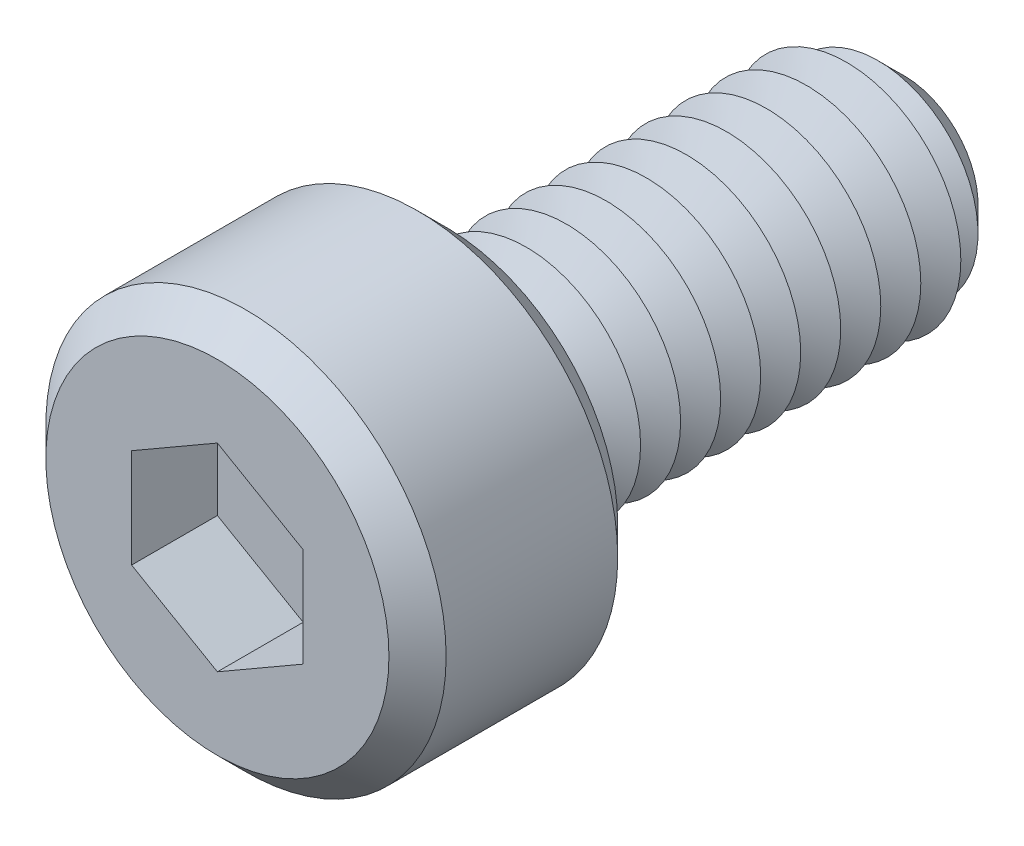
ISO-10303-21;
HEADER;
FILE_DESCRIPTION(('STEP AP214'),'2;1');
FILE_NAME('part.step','',(''),(''),'','','');
FILE_SCHEMA(('AUTOMOTIVE_DESIGN { 1 0 10303 214 1 1 1 1 }'));
ENDSEC;
DATA;
#1=APPLICATION_CONTEXT('core data for automotive mechanical design processes');
#2=APPLICATION_PROTOCOL_DEFINITION('international standard','automotive_design',2000,#1);
#3=PRODUCT_CONTEXT('',#1,'mechanical');
#4=PRODUCT('Part','Part','',(#3));
#5=PRODUCT_RELATED_PRODUCT_CATEGORY('part','',(#4));
#6=PRODUCT_DEFINITION_FORMATION('','',#4);
#7=PRODUCT_DEFINITION_CONTEXT('part definition',#1,'design');
#8=PRODUCT_DEFINITION('design','',#6,#7);
#9=PRODUCT_DEFINITION_SHAPE('','',#8);
#10=(LENGTH_UNIT() NAMED_UNIT(*) SI_UNIT(.MILLI.,.METRE.));
#11=(NAMED_UNIT(*) PLANE_ANGLE_UNIT() SI_UNIT($,.RADIAN.));
#12=(NAMED_UNIT(*) SI_UNIT($,.STERADIAN.) SOLID_ANGLE_UNIT());
#13=UNCERTAINTY_MEASURE_WITH_UNIT(LENGTH_MEASURE(1.E-05),#10,'distance_accuracy_value','');
#14=(GEOMETRIC_REPRESENTATION_CONTEXT(3) GLOBAL_UNCERTAINTY_ASSIGNED_CONTEXT((#13)) GLOBAL_UNIT_ASSIGNED_CONTEXT((#10,
#11,#12)) REPRESENTATION_CONTEXT('',''));
#15=CARTESIAN_POINT('',(0.,0.,0.));
#16=DIRECTION('',(0.,0.,1.));
#17=DIRECTION('',(1.,0.,0.));
#18=AXIS2_PLACEMENT_3D('',#15,#16,#17);
#19=CARTESIAN_POINT('',(0.,0.,4.));
#20=DIRECTION('',(0.,0.,-1.));
#21=DIRECTION('',(-1.,0.,0.));
#22=AXIS2_PLACEMENT_3D('',#19,#20,#21);
#23=CYLINDRICAL_SURFACE('',#22,3.5);
#24=CARTESIAN_POINT('',(0.,0.,0.5));
#25=DIRECTION('',(0.,0.,1.));
#26=DIRECTION('',(1.,0.,0.));
#27=AXIS2_PLACEMENT_3D('',#24,#25,#26);
#28=CIRCLE('',#27,3.5);
#29=CARTESIAN_POINT('',(3.5,0.,0.5));
#30=VERTEX_POINT('',#29);
#31=EDGE_CURVE('E264',#30,#30,#28,.T.);
#32=ORIENTED_EDGE('',*,*,#31,.T.);
#33=EDGE_LOOP('',(#32));
#34=FACE_BOUND('',#33,.T.);
#35=CARTESIAN_POINT('',(0.,0.,3.5));
#36=DIRECTION('',(0.,0.,1.));
#37=DIRECTION('',(1.,0.,0.));
#38=AXIS2_PLACEMENT_3D('',#35,#36,#37);
#39=CIRCLE('',#38,3.5);
#40=CARTESIAN_POINT('',(3.5,0.,3.5));
#41=VERTEX_POINT('',#40);
#42=EDGE_CURVE('E257',#41,#41,#39,.F.);
#43=ORIENTED_EDGE('',*,*,#42,.T.);
#44=EDGE_LOOP('',(#43));
#45=FACE_BOUND('',#44,.T.);
#46=ADVANCED_FACE('F39',(#34,#45),#23,.T.);
#47=CARTESIAN_POINT('',(0.,0.,4.));
#48=DIRECTION('',(0.,0.,1.));
#49=DIRECTION('',(1.,0.,0.));
#50=AXIS2_PLACEMENT_3D('',#47,#48,#49);
#51=PLANE('',#50);
#52=CARTESIAN_POINT('',(0.,0.,4.));
#53=DIRECTION('',(0.,0.,1.));
#54=DIRECTION('',(1.,0.,0.));
#55=AXIS2_PLACEMENT_3D('',#52,#53,#54);
#56=CIRCLE('',#55,3.);
#57=CARTESIAN_POINT('',(3.,0.,4.));
#58=VERTEX_POINT('',#57);
#59=EDGE_CURVE('E11',#58,#58,#56,.T.);
#60=ORIENTED_EDGE('',*,*,#59,.T.);
#61=EDGE_LOOP('',(#60));
#62=FACE_BOUND('',#61,.T.);
#63=DIRECTION('',(-0.866025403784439,0.5,0.));
#64=VECTOR('',#63,1.);
#65=CARTESIAN_POINT('',(1.5,0.866025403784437,4.));
#66=LINE('',#65,#64);
#67=CARTESIAN_POINT('',(1.5,0.866025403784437,4.));
#68=VERTEX_POINT('',#67);
#69=CARTESIAN_POINT('',(0.,1.73205080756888,4.));
#70=VERTEX_POINT('',#69);
#71=EDGE_CURVE('E55',#68,#70,#66,.T.);
#72=ORIENTED_EDGE('',*,*,#71,.F.);
#73=DIRECTION('',(0.,1.,0.));
#74=VECTOR('',#73,1.);
#75=CARTESIAN_POINT('',(1.5,-0.866025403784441,4.));
#76=LINE('',#75,#74);
#77=CARTESIAN_POINT('',(1.5,-0.866025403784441,4.));
#78=VERTEX_POINT('',#77);
#79=EDGE_CURVE('E151',#78,#68,#76,.T.);
#80=ORIENTED_EDGE('',*,*,#79,.F.);
#81=DIRECTION('',(0.866025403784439,0.5,0.));
#82=VECTOR('',#81,1.);
#83=CARTESIAN_POINT('',(0.,-1.73205080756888,4.));
#84=LINE('',#83,#82);
#85=CARTESIAN_POINT('',(0.,-1.73205080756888,4.));
#86=VERTEX_POINT('',#85);
#87=EDGE_CURVE('E148',#86,#78,#84,.T.);
#88=ORIENTED_EDGE('',*,*,#87,.F.);
#89=DIRECTION('',(0.866025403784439,-0.5,0.));
#90=VECTOR('',#89,1.);
#91=CARTESIAN_POINT('',(-1.5,-0.86602540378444,4.));
#92=LINE('',#91,#90);
#93=CARTESIAN_POINT('',(-1.5,-0.86602540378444,4.));
#94=VERTEX_POINT('',#93);
#95=EDGE_CURVE('E103',#94,#86,#92,.T.);
#96=ORIENTED_EDGE('',*,*,#95,.F.);
#97=DIRECTION('',(0.,-1.,0.));
#98=VECTOR('',#97,1.);
#99=CARTESIAN_POINT('',(-1.5,0.866025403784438,4.));
#100=LINE('',#99,#98);
#101=CARTESIAN_POINT('',(-1.5,0.866025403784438,4.));
#102=VERTEX_POINT('',#101);
#103=EDGE_CURVE('E142',#102,#94,#100,.T.);
#104=ORIENTED_EDGE('',*,*,#103,.F.);
#105=DIRECTION('',(-0.866025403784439,-0.5,0.));
#106=VECTOR('',#105,1.);
#107=CARTESIAN_POINT('',(0.,1.73205080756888,4.));
#108=LINE('',#107,#106);
#109=EDGE_CURVE('E137',#70,#102,#108,.T.);
#110=ORIENTED_EDGE('',*,*,#109,.F.);
#111=EDGE_LOOP('',(#72,#80,#88,#96,#104,#110));
#112=FACE_BOUND('',#111,.T.);
#113=ADVANCED_FACE('F282',(#62,#112),#51,.T.);
#114=CARTESIAN_POINT('',(0.,0.,0.));
#115=DIRECTION('',(0.,0.,1.));
#116=DIRECTION('',(1.,0.,0.));
#117=AXIS2_PLACEMENT_3D('',#114,#115,#116);
#118=PLANE('',#117);
#119=CARTESIAN_POINT('',(0.,0.,0.));
#120=DIRECTION('',(0.,0.,1.));
#121=DIRECTION('',(1.,0.,0.));
#122=AXIS2_PLACEMENT_3D('',#119,#120,#121);
#123=CIRCLE('',#122,3.);
#124=CARTESIAN_POINT('',(3.,0.,0.));
#125=VERTEX_POINT('',#124);
#126=EDGE_CURVE('E48',#125,#125,#123,.F.);
#127=ORIENTED_EDGE('',*,*,#126,.T.);
#128=EDGE_LOOP('',(#127));
#129=FACE_BOUND('',#128,.T.);
#130=CARTESIAN_POINT('',(0.,0.,0.));
#131=DIRECTION('',(0.,0.,1.));
#132=DIRECTION('',(1.,0.,0.));
#133=AXIS2_PLACEMENT_3D('',#130,#131,#132);
#134=CIRCLE('',#133,2.);
#135=CARTESIAN_POINT('',(2.,0.,0.));
#136=VERTEX_POINT('',#135);
#137=EDGE_CURVE('E249',#136,#136,#134,.T.);
#138=ORIENTED_EDGE('',*,*,#137,.T.);
#139=EDGE_LOOP('',(#138));
#140=FACE_BOUND('',#139,.T.);
#141=ADVANCED_FACE('F271',(#129,#140),#118,.F.);
#142=CARTESIAN_POINT('',(0.,0.,0.));
#143=DIRECTION('',(0.,0.,1.));
#144=DIRECTION('',(1.,0.,0.));
#145=AXIS2_PLACEMENT_3D('',#142,#143,#144);
#146=CONICAL_SURFACE('',#145,2.,1.0471975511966);
#147=CARTESIAN_POINT('',(0.,0.,-0.35));
#148=DIRECTION('',(0.,0.,1.));
#149=DIRECTION('',(1.,0.,0.));
#150=AXIS2_PLACEMENT_3D('',#147,#148,#149);
#151=CIRCLE('',#150,1.39378221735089);
#152=CARTESIAN_POINT('',(1.39378221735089,0.,-0.35));
#153=VERTEX_POINT('',#152);
#154=EDGE_CURVE('E245',#153,#153,#151,.T.);
#155=ORIENTED_EDGE('',*,*,#154,.T.);
#156=EDGE_LOOP('',(#155));
#157=FACE_BOUND('',#156,.T.);
#158=ORIENTED_EDGE('',*,*,#137,.F.);
#159=EDGE_LOOP('',(#158));
#160=FACE_BOUND('',#159,.T.);
#161=ADVANCED_FACE('F420',(#157,#160),#146,.T.);
#162=CARTESIAN_POINT('',(0.,0.,-0.35));
#163=DIRECTION('',(0.,0.,-1.));
#164=DIRECTION('',(-1.,0.,0.));
#165=AXIS2_PLACEMENT_3D('',#162,#163,#164);
#166=CONICAL_SURFACE('',#165,1.39378221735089,1.0471975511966);
#167=CARTESIAN_POINT('',(0.,0.,-0.7));
#168=DIRECTION('',(0.,0.,1.));
#169=DIRECTION('',(1.,0.,0.));
#170=AXIS2_PLACEMENT_3D('',#167,#168,#169);
#171=CIRCLE('',#170,2.);
#172=CARTESIAN_POINT('',(2.,0.,-0.7));
#173=VERTEX_POINT('',#172);
#174=EDGE_CURVE('E241',#173,#173,#171,.T.);
#175=ORIENTED_EDGE('',*,*,#174,.T.);
#176=EDGE_LOOP('',(#175));
#177=FACE_BOUND('',#176,.T.);
#178=ORIENTED_EDGE('',*,*,#154,.F.);
#179=EDGE_LOOP('',(#178));
#180=FACE_BOUND('',#179,.T.);
#181=ADVANCED_FACE('F416',(#177,#180),#166,.T.);
#182=CARTESIAN_POINT('',(0.,0.,-0.7));
#183=DIRECTION('',(0.,0.,1.));
#184=DIRECTION('',(1.,0.,0.));
#185=AXIS2_PLACEMENT_3D('',#182,#183,#184);
#186=CONICAL_SURFACE('',#185,2.,1.0471975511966);
#187=CARTESIAN_POINT('',(0.,0.,-1.05));
#188=DIRECTION('',(0.,0.,1.));
#189=DIRECTION('',(1.,0.,0.));
#190=AXIS2_PLACEMENT_3D('',#187,#188,#189);
#191=CIRCLE('',#190,1.39378221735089);
#192=CARTESIAN_POINT('',(1.39378221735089,0.,-1.05));
#193=VERTEX_POINT('',#192);
#194=EDGE_CURVE('E237',#193,#193,#191,.T.);
#195=ORIENTED_EDGE('',*,*,#194,.T.);
#196=EDGE_LOOP('',(#195));
#197=FACE_BOUND('',#196,.T.);
#198=ORIENTED_EDGE('',*,*,#174,.F.);
#199=EDGE_LOOP('',(#198));
#200=FACE_BOUND('',#199,.T.);
#201=ADVANCED_FACE('F412',(#197,#200),#186,.T.);
#202=CARTESIAN_POINT('',(0.,0.,-1.05));
#203=DIRECTION('',(0.,0.,-1.));
#204=DIRECTION('',(-1.,0.,0.));
#205=AXIS2_PLACEMENT_3D('',#202,#203,#204);
#206=CONICAL_SURFACE('',#205,1.39378221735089,1.0471975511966);
#207=CARTESIAN_POINT('',(0.,0.,-1.4));
#208=DIRECTION('',(0.,0.,1.));
#209=DIRECTION('',(1.,0.,0.));
#210=AXIS2_PLACEMENT_3D('',#207,#208,#209);
#211=CIRCLE('',#210,2.);
#212=CARTESIAN_POINT('',(2.,0.,-1.4));
#213=VERTEX_POINT('',#212);
#214=EDGE_CURVE('E233',#213,#213,#211,.T.);
#215=ORIENTED_EDGE('',*,*,#214,.T.);
#216=EDGE_LOOP('',(#215));
#217=FACE_BOUND('',#216,.T.);
#218=ORIENTED_EDGE('',*,*,#194,.F.);
#219=EDGE_LOOP('',(#218));
#220=FACE_BOUND('',#219,.T.);
#221=ADVANCED_FACE('F408',(#217,#220),#206,.T.);
#222=CARTESIAN_POINT('',(0.,0.,-1.4));
#223=DIRECTION('',(0.,0.,1.));
#224=DIRECTION('',(1.,0.,0.));
#225=AXIS2_PLACEMENT_3D('',#222,#223,#224);
#226=CONICAL_SURFACE('',#225,2.,1.0471975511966);
#227=CARTESIAN_POINT('',(0.,0.,-1.75));
#228=DIRECTION('',(0.,0.,1.));
#229=DIRECTION('',(1.,0.,0.));
#230=AXIS2_PLACEMENT_3D('',#227,#228,#229);
#231=CIRCLE('',#230,1.39378221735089);
#232=CARTESIAN_POINT('',(1.39378221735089,0.,-1.75));
#233=VERTEX_POINT('',#232);
#234=EDGE_CURVE('E229',#233,#233,#231,.T.);
#235=ORIENTED_EDGE('',*,*,#234,.T.);
#236=EDGE_LOOP('',(#235));
#237=FACE_BOUND('',#236,.T.);
#238=ORIENTED_EDGE('',*,*,#214,.F.);
#239=EDGE_LOOP('',(#238));
#240=FACE_BOUND('',#239,.T.);
#241=ADVANCED_FACE('F404',(#237,#240),#226,.T.);
#242=CARTESIAN_POINT('',(0.,0.,-1.75));
#243=DIRECTION('',(0.,0.,-1.));
#244=DIRECTION('',(-1.,0.,0.));
#245=AXIS2_PLACEMENT_3D('',#242,#243,#244);
#246=CONICAL_SURFACE('',#245,1.39378221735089,1.0471975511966);
#247=CARTESIAN_POINT('',(0.,0.,-2.1));
#248=DIRECTION('',(0.,0.,1.));
#249=DIRECTION('',(1.,0.,0.));
#250=AXIS2_PLACEMENT_3D('',#247,#248,#249);
#251=CIRCLE('',#250,2.);
#252=CARTESIAN_POINT('',(2.,0.,-2.1));
#253=VERTEX_POINT('',#252);
#254=EDGE_CURVE('E225',#253,#253,#251,.T.);
#255=ORIENTED_EDGE('',*,*,#254,.T.);
#256=EDGE_LOOP('',(#255));
#257=FACE_BOUND('',#256,.T.);
#258=ORIENTED_EDGE('',*,*,#234,.F.);
#259=EDGE_LOOP('',(#258));
#260=FACE_BOUND('',#259,.T.);
#261=ADVANCED_FACE('F400',(#257,#260),#246,.T.);
#262=CARTESIAN_POINT('',(0.,0.,-2.1));
#263=DIRECTION('',(0.,0.,1.));
#264=DIRECTION('',(1.,0.,0.));
#265=AXIS2_PLACEMENT_3D('',#262,#263,#264);
#266=CONICAL_SURFACE('',#265,2.,1.0471975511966);
#267=CARTESIAN_POINT('',(0.,0.,-2.45));
#268=DIRECTION('',(0.,0.,1.));
#269=DIRECTION('',(1.,0.,0.));
#270=AXIS2_PLACEMENT_3D('',#267,#268,#269);
#271=CIRCLE('',#270,1.39378221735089);
#272=CARTESIAN_POINT('',(1.39378221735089,0.,-2.45));
#273=VERTEX_POINT('',#272);
#274=EDGE_CURVE('E221',#273,#273,#271,.T.);
#275=ORIENTED_EDGE('',*,*,#274,.T.);
#276=EDGE_LOOP('',(#275));
#277=FACE_BOUND('',#276,.T.);
#278=ORIENTED_EDGE('',*,*,#254,.F.);
#279=EDGE_LOOP('',(#278));
#280=FACE_BOUND('',#279,.T.);
#281=ADVANCED_FACE('F396',(#277,#280),#266,.T.);
#282=CARTESIAN_POINT('',(0.,0.,-2.45));
#283=DIRECTION('',(0.,0.,-1.));
#284=DIRECTION('',(-1.,0.,0.));
#285=AXIS2_PLACEMENT_3D('',#282,#283,#284);
#286=CONICAL_SURFACE('',#285,1.39378221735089,1.0471975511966);
#287=CARTESIAN_POINT('',(0.,0.,-2.8));
#288=DIRECTION('',(0.,0.,1.));
#289=DIRECTION('',(1.,0.,0.));
#290=AXIS2_PLACEMENT_3D('',#287,#288,#289);
#291=CIRCLE('',#290,2.);
#292=CARTESIAN_POINT('',(2.,0.,-2.8));
#293=VERTEX_POINT('',#292);
#294=EDGE_CURVE('E217',#293,#293,#291,.T.);
#295=ORIENTED_EDGE('',*,*,#294,.T.);
#296=EDGE_LOOP('',(#295));
#297=FACE_BOUND('',#296,.T.);
#298=ORIENTED_EDGE('',*,*,#274,.F.);
#299=EDGE_LOOP('',(#298));
#300=FACE_BOUND('',#299,.T.);
#301=ADVANCED_FACE('F392',(#297,#300),#286,.T.);
#302=CARTESIAN_POINT('',(0.,0.,-2.8));
#303=DIRECTION('',(0.,0.,1.));
#304=DIRECTION('',(1.,0.,0.));
#305=AXIS2_PLACEMENT_3D('',#302,#303,#304);
#306=CONICAL_SURFACE('',#305,2.,1.0471975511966);
#307=CARTESIAN_POINT('',(0.,0.,-3.15));
#308=DIRECTION('',(0.,0.,1.));
#309=DIRECTION('',(1.,0.,0.));
#310=AXIS2_PLACEMENT_3D('',#307,#308,#309);
#311=CIRCLE('',#310,1.39378221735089);
#312=CARTESIAN_POINT('',(1.39378221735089,0.,-3.15));
#313=VERTEX_POINT('',#312);
#314=EDGE_CURVE('E214',#313,#313,#311,.T.);
#315=ORIENTED_EDGE('',*,*,#314,.T.);
#316=EDGE_LOOP('',(#315));
#317=FACE_BOUND('',#316,.T.);
#318=ORIENTED_EDGE('',*,*,#294,.F.);
#319=EDGE_LOOP('',(#318));
#320=FACE_BOUND('',#319,.T.);
#321=ADVANCED_FACE('F388',(#317,#320),#306,.T.);
#322=CARTESIAN_POINT('',(0.,0.,-3.15));
#323=DIRECTION('',(0.,0.,-1.));
#324=DIRECTION('',(-1.,0.,0.));
#325=AXIS2_PLACEMENT_3D('',#322,#323,#324);
#326=CONICAL_SURFACE('',#325,1.39378221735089,1.0471975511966);
#327=CARTESIAN_POINT('',(0.,0.,-3.5));
#328=DIRECTION('',(0.,0.,1.));
#329=DIRECTION('',(1.,0.,0.));
#330=AXIS2_PLACEMENT_3D('',#327,#328,#329);
#331=CIRCLE('',#330,2.);
#332=CARTESIAN_POINT('',(2.,0.,-3.5));
#333=VERTEX_POINT('',#332);
#334=EDGE_CURVE('E210',#333,#333,#331,.T.);
#335=ORIENTED_EDGE('',*,*,#334,.T.);
#336=EDGE_LOOP('',(#335));
#337=FACE_BOUND('',#336,.T.);
#338=ORIENTED_EDGE('',*,*,#314,.F.);
#339=EDGE_LOOP('',(#338));
#340=FACE_BOUND('',#339,.T.);
#341=ADVANCED_FACE('F384',(#337,#340),#326,.T.);
#342=CARTESIAN_POINT('',(0.,0.,-3.5));
#343=DIRECTION('',(0.,0.,1.));
#344=DIRECTION('',(1.,0.,0.));
#345=AXIS2_PLACEMENT_3D('',#342,#343,#344);
#346=CONICAL_SURFACE('',#345,2.,1.0471975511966);
#347=CARTESIAN_POINT('',(0.,0.,-3.85));
#348=DIRECTION('',(0.,0.,1.));
#349=DIRECTION('',(1.,0.,0.));
#350=AXIS2_PLACEMENT_3D('',#347,#348,#349);
#351=CIRCLE('',#350,1.39378221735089);
#352=CARTESIAN_POINT('',(1.39378221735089,0.,-3.85));
#353=VERTEX_POINT('',#352);
#354=EDGE_CURVE('E206',#353,#353,#351,.T.);
#355=ORIENTED_EDGE('',*,*,#354,.T.);
#356=EDGE_LOOP('',(#355));
#357=FACE_BOUND('',#356,.T.);
#358=ORIENTED_EDGE('',*,*,#334,.F.);
#359=EDGE_LOOP('',(#358));
#360=FACE_BOUND('',#359,.T.);
#361=ADVANCED_FACE('F380',(#357,#360),#346,.T.);
#362=CARTESIAN_POINT('',(0.,0.,-3.85));
#363=DIRECTION('',(0.,0.,-1.));
#364=DIRECTION('',(-1.,0.,0.));
#365=AXIS2_PLACEMENT_3D('',#362,#363,#364);
#366=CONICAL_SURFACE('',#365,1.39378221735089,1.0471975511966);
#367=CARTESIAN_POINT('',(0.,0.,-4.2));
#368=DIRECTION('',(0.,0.,1.));
#369=DIRECTION('',(1.,0.,0.));
#370=AXIS2_PLACEMENT_3D('',#367,#368,#369);
#371=CIRCLE('',#370,2.);
#372=CARTESIAN_POINT('',(2.,0.,-4.2));
#373=VERTEX_POINT('',#372);
#374=EDGE_CURVE('E202',#373,#373,#371,.T.);
#375=ORIENTED_EDGE('',*,*,#374,.T.);
#376=EDGE_LOOP('',(#375));
#377=FACE_BOUND('',#376,.T.);
#378=ORIENTED_EDGE('',*,*,#354,.F.);
#379=EDGE_LOOP('',(#378));
#380=FACE_BOUND('',#379,.T.);
#381=ADVANCED_FACE('F376',(#377,#380),#366,.T.);
#382=CARTESIAN_POINT('',(0.,0.,-4.2));
#383=DIRECTION('',(0.,0.,1.));
#384=DIRECTION('',(1.,0.,0.));
#385=AXIS2_PLACEMENT_3D('',#382,#383,#384);
#386=CONICAL_SURFACE('',#385,2.,1.0471975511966);
#387=CARTESIAN_POINT('',(0.,0.,-4.55));
#388=DIRECTION('',(0.,0.,1.));
#389=DIRECTION('',(1.,0.,0.));
#390=AXIS2_PLACEMENT_3D('',#387,#388,#389);
#391=CIRCLE('',#390,1.39378221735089);
#392=CARTESIAN_POINT('',(1.39378221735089,0.,-4.55));
#393=VERTEX_POINT('',#392);
#394=EDGE_CURVE('E198',#393,#393,#391,.T.);
#395=ORIENTED_EDGE('',*,*,#394,.T.);
#396=EDGE_LOOP('',(#395));
#397=FACE_BOUND('',#396,.T.);
#398=ORIENTED_EDGE('',*,*,#374,.F.);
#399=EDGE_LOOP('',(#398));
#400=FACE_BOUND('',#399,.T.);
#401=ADVANCED_FACE('F372',(#397,#400),#386,.T.);
#402=CARTESIAN_POINT('',(0.,0.,-4.55));
#403=DIRECTION('',(0.,0.,-1.));
#404=DIRECTION('',(-1.,0.,0.));
#405=AXIS2_PLACEMENT_3D('',#402,#403,#404);
#406=CONICAL_SURFACE('',#405,1.39378221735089,1.0471975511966);
#407=CARTESIAN_POINT('',(0.,0.,-4.9));
#408=DIRECTION('',(0.,0.,1.));
#409=DIRECTION('',(1.,0.,0.));
#410=AXIS2_PLACEMENT_3D('',#407,#408,#409);
#411=CIRCLE('',#410,2.);
#412=CARTESIAN_POINT('',(2.,0.,-4.9));
#413=VERTEX_POINT('',#412);
#414=EDGE_CURVE('E194',#413,#413,#411,.T.);
#415=ORIENTED_EDGE('',*,*,#414,.T.);
#416=EDGE_LOOP('',(#415));
#417=FACE_BOUND('',#416,.T.);
#418=ORIENTED_EDGE('',*,*,#394,.F.);
#419=EDGE_LOOP('',(#418));
#420=FACE_BOUND('',#419,.T.);
#421=ADVANCED_FACE('F368',(#417,#420),#406,.T.);
#422=CARTESIAN_POINT('',(0.,0.,-4.9));
#423=DIRECTION('',(0.,0.,1.));
#424=DIRECTION('',(1.,0.,0.));
#425=AXIS2_PLACEMENT_3D('',#422,#423,#424);
#426=CONICAL_SURFACE('',#425,2.,1.0471975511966);
#427=CARTESIAN_POINT('',(0.,0.,-5.25));
#428=DIRECTION('',(0.,0.,1.));
#429=DIRECTION('',(1.,0.,0.));
#430=AXIS2_PLACEMENT_3D('',#427,#428,#429);
#431=CIRCLE('',#430,1.39378221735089);
#432=CARTESIAN_POINT('',(1.39378221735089,0.,-5.25));
#433=VERTEX_POINT('',#432);
#434=EDGE_CURVE('E190',#433,#433,#431,.T.);
#435=ORIENTED_EDGE('',*,*,#434,.T.);
#436=EDGE_LOOP('',(#435));
#437=FACE_BOUND('',#436,.T.);
#438=ORIENTED_EDGE('',*,*,#414,.F.);
#439=EDGE_LOOP('',(#438));
#440=FACE_BOUND('',#439,.T.);
#441=ADVANCED_FACE('F364',(#437,#440),#426,.T.);
#442=CARTESIAN_POINT('',(0.,0.,-5.25));
#443=DIRECTION('',(0.,0.,-1.));
#444=DIRECTION('',(-1.,0.,0.));
#445=AXIS2_PLACEMENT_3D('',#442,#443,#444);
#446=CONICAL_SURFACE('',#445,1.39378221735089,1.0471975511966);
#447=CARTESIAN_POINT('',(0.,0.,-5.6));
#448=DIRECTION('',(0.,0.,1.));
#449=DIRECTION('',(1.,0.,0.));
#450=AXIS2_PLACEMENT_3D('',#447,#448,#449);
#451=CIRCLE('',#450,2.);
#452=CARTESIAN_POINT('',(2.,0.,-5.6));
#453=VERTEX_POINT('',#452);
#454=EDGE_CURVE('E186',#453,#453,#451,.T.);
#455=ORIENTED_EDGE('',*,*,#454,.T.);
#456=EDGE_LOOP('',(#455));
#457=FACE_BOUND('',#456,.T.);
#458=ORIENTED_EDGE('',*,*,#434,.F.);
#459=EDGE_LOOP('',(#458));
#460=FACE_BOUND('',#459,.T.);
#461=ADVANCED_FACE('F360',(#457,#460),#446,.T.);
#462=CARTESIAN_POINT('',(0.,0.,-5.6));
#463=DIRECTION('',(0.,0.,1.));
#464=DIRECTION('',(1.,0.,0.));
#465=AXIS2_PLACEMENT_3D('',#462,#463,#464);
#466=CONICAL_SURFACE('',#465,2.,1.0471975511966);
#467=CARTESIAN_POINT('',(0.,0.,-5.95));
#468=DIRECTION('',(0.,0.,1.));
#469=DIRECTION('',(1.,0.,0.));
#470=AXIS2_PLACEMENT_3D('',#467,#468,#469);
#471=CIRCLE('',#470,1.39378221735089);
#472=CARTESIAN_POINT('',(1.39378221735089,0.,-5.95));
#473=VERTEX_POINT('',#472);
#474=EDGE_CURVE('E182',#473,#473,#471,.T.);
#475=ORIENTED_EDGE('',*,*,#474,.T.);
#476=EDGE_LOOP('',(#475));
#477=FACE_BOUND('',#476,.T.);
#478=ORIENTED_EDGE('',*,*,#454,.F.);
#479=EDGE_LOOP('',(#478));
#480=FACE_BOUND('',#479,.T.);
#481=ADVANCED_FACE('F356',(#477,#480),#466,.T.);
#482=CARTESIAN_POINT('',(0.,0.,-5.95));
#483=DIRECTION('',(0.,0.,-1.));
#484=DIRECTION('',(-1.,0.,0.));
#485=AXIS2_PLACEMENT_3D('',#482,#483,#484);
#486=CONICAL_SURFACE('',#485,1.39378221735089,1.0471975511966);
#487=CARTESIAN_POINT('',(0.,0.,-6.3));
#488=DIRECTION('',(0.,0.,1.));
#489=DIRECTION('',(1.,0.,0.));
#490=AXIS2_PLACEMENT_3D('',#487,#488,#489);
#491=CIRCLE('',#490,2.);
#492=CARTESIAN_POINT('',(2.,0.,-6.3));
#493=VERTEX_POINT('',#492);
#494=EDGE_CURVE('E178',#493,#493,#491,.T.);
#495=ORIENTED_EDGE('',*,*,#494,.T.);
#496=EDGE_LOOP('',(#495));
#497=FACE_BOUND('',#496,.T.);
#498=ORIENTED_EDGE('',*,*,#474,.F.);
#499=EDGE_LOOP('',(#498));
#500=FACE_BOUND('',#499,.T.);
#501=ADVANCED_FACE('F352',(#497,#500),#486,.T.);
#502=CARTESIAN_POINT('',(0.,0.,-6.3));
#503=DIRECTION('',(0.,0.,1.));
#504=DIRECTION('',(1.,0.,0.));
#505=AXIS2_PLACEMENT_3D('',#502,#503,#504);
#506=CONICAL_SURFACE('',#505,2.,1.0471975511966);
#507=CARTESIAN_POINT('',(0.,0.,-6.65));
#508=DIRECTION('',(0.,0.,1.));
#509=DIRECTION('',(1.,0.,0.));
#510=AXIS2_PLACEMENT_3D('',#507,#508,#509);
#511=CIRCLE('',#510,1.39378221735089);
#512=CARTESIAN_POINT('',(1.39378221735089,0.,-6.65));
#513=VERTEX_POINT('',#512);
#514=EDGE_CURVE('E175',#513,#513,#511,.T.);
#515=ORIENTED_EDGE('',*,*,#514,.T.);
#516=EDGE_LOOP('',(#515));
#517=FACE_BOUND('',#516,.T.);
#518=ORIENTED_EDGE('',*,*,#494,.F.);
#519=EDGE_LOOP('',(#518));
#520=FACE_BOUND('',#519,.T.);
#521=ADVANCED_FACE('F348',(#517,#520),#506,.T.);
#522=CARTESIAN_POINT('',(0.,0.,-6.65));
#523=DIRECTION('',(0.,0.,-1.));
#524=DIRECTION('',(-1.,0.,0.));
#525=AXIS2_PLACEMENT_3D('',#522,#523,#524);
#526=CONICAL_SURFACE('',#525,1.39378221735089,1.0471975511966);
#527=CARTESIAN_POINT('',(0.,0.,-7.));
#528=DIRECTION('',(0.,0.,1.));
#529=DIRECTION('',(1.,0.,0.));
#530=AXIS2_PLACEMENT_3D('',#527,#528,#529);
#531=CIRCLE('',#530,2.);
#532=CARTESIAN_POINT('',(2.,0.,-7.));
#533=VERTEX_POINT('',#532);
#534=EDGE_CURVE('E170',#533,#533,#531,.T.);
#535=ORIENTED_EDGE('',*,*,#534,.T.);
#536=EDGE_LOOP('',(#535));
#537=FACE_BOUND('',#536,.T.);
#538=ORIENTED_EDGE('',*,*,#514,.F.);
#539=EDGE_LOOP('',(#538));
#540=FACE_BOUND('',#539,.T.);
#541=ADVANCED_FACE('F344',(#537,#540),#526,.T.);
#542=CARTESIAN_POINT('',(0.,0.,-7.));
#543=DIRECTION('',(0.,0.,1.));
#544=DIRECTION('',(1.,0.,0.));
#545=AXIS2_PLACEMENT_3D('',#542,#543,#544);
#546=CONICAL_SURFACE('',#545,2.,1.0471975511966);
#547=CARTESIAN_POINT('',(0.,0.,-7.35));
#548=DIRECTION('',(0.,0.,1.));
#549=DIRECTION('',(1.,0.,0.));
#550=AXIS2_PLACEMENT_3D('',#547,#548,#549);
#551=CIRCLE('',#550,1.39378221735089);
#552=CARTESIAN_POINT('',(1.39378221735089,0.,-7.35));
#553=VERTEX_POINT('',#552);
#554=EDGE_CURVE('E157',#553,#553,#551,.T.);
#555=ORIENTED_EDGE('',*,*,#554,.T.);
#556=EDGE_LOOP('',(#555));
#557=FACE_BOUND('',#556,.T.);
#558=ORIENTED_EDGE('',*,*,#534,.F.);
#559=EDGE_LOOP('',(#558));
#560=FACE_BOUND('',#559,.T.);
#561=ADVANCED_FACE('F340',(#557,#560),#546,.T.);
#562=CARTESIAN_POINT('',(0.,0.,-7.35));
#563=DIRECTION('',(0.,0.,-1.));
#564=DIRECTION('',(-1.,0.,0.));
#565=AXIS2_PLACEMENT_3D('',#562,#563,#564);
#566=CONICAL_SURFACE('',#565,1.39378221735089,1.0471975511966);
#567=CARTESIAN_POINT('',(0.,0.,-7.55358983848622));
#568=DIRECTION('',(0.,0.,-1.));
#569=DIRECTION('',(-1.,0.,0.));
#570=AXIS2_PLACEMENT_3D('',#567,#568,#569);
#571=CIRCLE('',#570,1.74641016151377);
#572=CARTESIAN_POINT('',(-1.74641016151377,0.,-7.55358983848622));
#573=VERTEX_POINT('',#572);
#574=EDGE_CURVE('E174',#573,#573,#571,.T.);
#575=ORIENTED_EDGE('',*,*,#574,.F.);
#576=EDGE_LOOP('',(#575));
#577=FACE_BOUND('',#576,.T.);
#578=ORIENTED_EDGE('',*,*,#554,.F.);
#579=EDGE_LOOP('',(#578));
#580=FACE_BOUND('',#579,.T.);
#581=ADVANCED_FACE('F336',(#577,#580),#566,.T.);
#582=CARTESIAN_POINT('',(0.,0.,-8.));
#583=DIRECTION('',(0.,0.,-1.));
#584=DIRECTION('',(-1.,0.,0.));
#585=AXIS2_PLACEMENT_3D('',#582,#583,#584);
#586=PLANE('',#585);
#587=CARTESIAN_POINT('',(0.,0.,-8.));
#588=DIRECTION('',(0.,0.,-1.));
#589=DIRECTION('',(-1.,0.,0.));
#590=AXIS2_PLACEMENT_3D('',#587,#588,#589);
#591=CIRCLE('',#590,0.5);
#592=CARTESIAN_POINT('',(-0.5,0.,-8.));
#593=VERTEX_POINT('',#592);
#594=EDGE_CURVE('E138',#593,#593,#591,.F.);
#595=ORIENTED_EDGE('',*,*,#594,.T.);
#596=EDGE_LOOP('',(#595));
#597=FACE_BOUND('',#596,.T.);
#598=CARTESIAN_POINT('',(0.,0.,-8.));
#599=DIRECTION('',(0.,0.,-1.));
#600=DIRECTION('',(-1.,0.,0.));
#601=AXIS2_PLACEMENT_3D('',#598,#599,#600);
#602=CIRCLE('',#601,1.3);
#603=CARTESIAN_POINT('',(-1.3,0.,-8.));
#604=VERTEX_POINT('',#603);
#605=EDGE_CURVE('E253',#604,#604,#602,.T.);
#606=ORIENTED_EDGE('',*,*,#605,.T.);
#607=EDGE_LOOP('',(#606));
#608=FACE_BOUND('',#607,.T.);
#609=ADVANCED_FACE('F339',(#597,#608),#586,.T.);
#610=CARTESIAN_POINT('',(0.,0.,-8.));
#611=DIRECTION('',(0.,0.,1.));
#612=DIRECTION('',(1.,0.,0.));
#613=AXIS2_PLACEMENT_3D('',#610,#611,#612);
#614=CONICAL_SURFACE('',#613,1.3,0.785398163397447);
#615=ORIENTED_EDGE('',*,*,#605,.F.);
#616=EDGE_LOOP('',(#615));
#617=FACE_BOUND('',#616,.T.);
#618=ORIENTED_EDGE('',*,*,#574,.T.);
#619=EDGE_LOOP('',(#618));
#620=FACE_BOUND('',#619,.T.);
#621=ADVANCED_FACE('F335',(#617,#620),#614,.T.);
#622=CARTESIAN_POINT('',(1.5,0.866025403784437,2.5));
#623=DIRECTION('',(0.5,0.866025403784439,0.));
#624=DIRECTION('',(-0.866025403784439,0.5,0.));
#625=AXIS2_PLACEMENT_3D('',#622,#623,#624);
#626=PLANE('',#625);
#627=ORIENTED_EDGE('',*,*,#71,.T.);
#628=DIRECTION('',(0.,0.,1.));
#629=VECTOR('',#628,1.);
#630=CARTESIAN_POINT('',(0.,1.73205080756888,2.5));
#631=LINE('',#630,#629);
#632=CARTESIAN_POINT('',(0.,1.73205080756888,2.5));
#633=VERTEX_POINT('',#632);
#634=EDGE_CURVE('E85',#633,#70,#631,.T.);
#635=ORIENTED_EDGE('',*,*,#634,.F.);
#636=DIRECTION('',(-0.866025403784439,0.5,0.));
#637=VECTOR('',#636,1.);
#638=CARTESIAN_POINT('',(1.5,0.866025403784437,2.5));
#639=LINE('',#638,#637);
#640=CARTESIAN_POINT('',(1.5,0.866025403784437,2.5));
#641=VERTEX_POINT('',#640);
#642=EDGE_CURVE('E154',#641,#633,#639,.T.);
#643=ORIENTED_EDGE('',*,*,#642,.F.);
#644=DIRECTION('',(0.,0.,1.));
#645=VECTOR('',#644,1.);
#646=CARTESIAN_POINT('',(1.5,0.866025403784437,2.5));
#647=LINE('',#646,#645);
#648=EDGE_CURVE('E63',#641,#68,#647,.T.);
#649=ORIENTED_EDGE('',*,*,#648,.T.);
#650=EDGE_LOOP('',(#627,#635,#643,#649));
#651=FACE_BOUND('',#650,.T.);
#652=ADVANCED_FACE('F325',(#651),#626,.F.);
#653=CARTESIAN_POINT('',(1.5,-0.866025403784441,2.5));
#654=DIRECTION('',(1.,0.,0.));
#655=DIRECTION('',(0.,1.,0.));
#656=AXIS2_PLACEMENT_3D('',#653,#654,#655);
#657=PLANE('',#656);
#658=ORIENTED_EDGE('',*,*,#79,.T.);
#659=ORIENTED_EDGE('',*,*,#648,.F.);
#660=DIRECTION('',(0.,1.,0.));
#661=VECTOR('',#660,1.);
#662=CARTESIAN_POINT('',(1.5,-0.866025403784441,2.5));
#663=LINE('',#662,#661);
#664=CARTESIAN_POINT('',(1.5,-0.866025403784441,2.5));
#665=VERTEX_POINT('',#664);
#666=EDGE_CURVE('E117',#665,#641,#663,.T.);
#667=ORIENTED_EDGE('',*,*,#666,.F.);
#668=DIRECTION('',(0.,0.,1.));
#669=VECTOR('',#668,1.);
#670=CARTESIAN_POINT('',(1.5,-0.866025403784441,2.5));
#671=LINE('',#670,#669);
#672=EDGE_CURVE('E108',#665,#78,#671,.T.);
#673=ORIENTED_EDGE('',*,*,#672,.T.);
#674=EDGE_LOOP('',(#658,#659,#667,#673));
#675=FACE_BOUND('',#674,.T.);
#676=ADVANCED_FACE('F322',(#675),#657,.F.);
#677=CARTESIAN_POINT('',(0.,-1.73205080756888,2.5));
#678=DIRECTION('',(0.5,-0.866025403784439,0.));
#679=DIRECTION('',(0.866025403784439,0.5,0.));
#680=AXIS2_PLACEMENT_3D('',#677,#678,#679);
#681=PLANE('',#680);
#682=ORIENTED_EDGE('',*,*,#87,.T.);
#683=ORIENTED_EDGE('',*,*,#672,.F.);
#684=DIRECTION('',(0.866025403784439,0.5,0.));
#685=VECTOR('',#684,1.);
#686=CARTESIAN_POINT('',(0.,-1.73205080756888,2.5));
#687=LINE('',#686,#685);
#688=CARTESIAN_POINT('',(0.,-1.73205080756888,2.5));
#689=VERTEX_POINT('',#688);
#690=EDGE_CURVE('E112',#689,#665,#687,.T.);
#691=ORIENTED_EDGE('',*,*,#690,.F.);
#692=DIRECTION('',(0.,0.,1.));
#693=VECTOR('',#692,1.);
#694=CARTESIAN_POINT('',(0.,-1.73205080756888,2.5));
#695=LINE('',#694,#693);
#696=EDGE_CURVE('E96',#689,#86,#695,.T.);
#697=ORIENTED_EDGE('',*,*,#696,.T.);
#698=EDGE_LOOP('',(#682,#683,#691,#697));
#699=FACE_BOUND('',#698,.T.);
#700=ADVANCED_FACE('F113',(#699),#681,.F.);
#701=CARTESIAN_POINT('',(-1.5,-0.86602540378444,2.5));
#702=DIRECTION('',(-0.5,-0.866025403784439,0.));
#703=DIRECTION('',(0.866025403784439,-0.5,0.));
#704=AXIS2_PLACEMENT_3D('',#701,#702,#703);
#705=PLANE('',#704);
#706=ORIENTED_EDGE('',*,*,#95,.T.);
#707=ORIENTED_EDGE('',*,*,#696,.F.);
#708=DIRECTION('',(0.866025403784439,-0.5,0.));
#709=VECTOR('',#708,1.);
#710=CARTESIAN_POINT('',(-1.5,-0.86602540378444,2.5));
#711=LINE('',#710,#709);
#712=CARTESIAN_POINT('',(-1.5,-0.86602540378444,2.5));
#713=VERTEX_POINT('',#712);
#714=EDGE_CURVE('E100',#713,#689,#711,.T.);
#715=ORIENTED_EDGE('',*,*,#714,.F.);
#716=DIRECTION('',(0.,0.,1.));
#717=VECTOR('',#716,1.);
#718=CARTESIAN_POINT('',(-1.5,-0.86602540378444,2.5));
#719=LINE('',#718,#717);
#720=EDGE_CURVE('E109',#713,#94,#719,.T.);
#721=ORIENTED_EDGE('',*,*,#720,.T.);
#722=EDGE_LOOP('',(#706,#707,#715,#721));
#723=FACE_BOUND('',#722,.T.);
#724=ADVANCED_FACE('F98',(#723),#705,.F.);
#725=CARTESIAN_POINT('',(-1.5,0.866025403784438,2.5));
#726=DIRECTION('',(-1.,0.,0.));
#727=DIRECTION('',(0.,0.,1.));
#728=AXIS2_PLACEMENT_3D('',#725,#726,#727);
#729=PLANE('',#728);
#730=ORIENTED_EDGE('',*,*,#103,.T.);
#731=ORIENTED_EDGE('',*,*,#720,.F.);
#732=DIRECTION('',(0.,-1.,0.));
#733=VECTOR('',#732,1.);
#734=CARTESIAN_POINT('',(-1.5,0.866025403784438,2.5));
#735=LINE('',#734,#733);
#736=CARTESIAN_POINT('',(-1.5,0.866025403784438,2.5));
#737=VERTEX_POINT('',#736);
#738=EDGE_CURVE('E123',#737,#713,#735,.T.);
#739=ORIENTED_EDGE('',*,*,#738,.F.);
#740=DIRECTION('',(0.,0.,1.));
#741=VECTOR('',#740,1.);
#742=CARTESIAN_POINT('',(-1.5,0.866025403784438,2.5));
#743=LINE('',#742,#741);
#744=EDGE_CURVE('E162',#737,#102,#743,.T.);
#745=ORIENTED_EDGE('',*,*,#744,.T.);
#746=EDGE_LOOP('',(#730,#731,#739,#745));
#747=FACE_BOUND('',#746,.T.);
#748=ADVANCED_FACE('F319',(#747),#729,.F.);
#749=CARTESIAN_POINT('',(0.,1.73205080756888,2.5));
#750=DIRECTION('',(-0.5,0.866025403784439,0.));
#751=DIRECTION('',(-0.866025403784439,-0.5,0.));
#752=AXIS2_PLACEMENT_3D('',#749,#750,#751);
#753=PLANE('',#752);
#754=ORIENTED_EDGE('',*,*,#109,.T.);
#755=ORIENTED_EDGE('',*,*,#744,.F.);
#756=DIRECTION('',(-0.866025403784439,-0.5,0.));
#757=VECTOR('',#756,1.);
#758=CARTESIAN_POINT('',(0.,1.73205080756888,2.5));
#759=LINE('',#758,#757);
#760=EDGE_CURVE('E129',#633,#737,#759,.T.);
#761=ORIENTED_EDGE('',*,*,#760,.F.);
#762=ORIENTED_EDGE('',*,*,#634,.T.);
#763=EDGE_LOOP('',(#754,#755,#761,#762));
#764=FACE_BOUND('',#763,.T.);
#765=ADVANCED_FACE('F297',(#764),#753,.F.);
#766=CARTESIAN_POINT('',(0.,0.,2.5));
#767=DIRECTION('',(0.,0.,1.));
#768=DIRECTION('',(1.,0.,0.));
#769=AXIS2_PLACEMENT_3D('',#766,#767,#768);
#770=PLANE('',#769);
#771=CARTESIAN_POINT('',(0.,0.,2.5));
#772=DIRECTION('',(0.,0.,1.));
#773=DIRECTION('',(1.,0.,0.));
#774=AXIS2_PLACEMENT_3D('',#771,#772,#773);
#775=CIRCLE('',#774,0.5);
#776=CARTESIAN_POINT('',(0.5,0.,2.5));
#777=VERTEX_POINT('',#776);
#778=EDGE_CURVE('E305',#777,#777,#775,.T.);
#779=ORIENTED_EDGE('',*,*,#778,.F.);
#780=EDGE_LOOP('',(#779));
#781=FACE_BOUND('',#780,.T.);
#782=ORIENTED_EDGE('',*,*,#642,.T.);
#783=ORIENTED_EDGE('',*,*,#760,.T.);
#784=ORIENTED_EDGE('',*,*,#738,.T.);
#785=ORIENTED_EDGE('',*,*,#714,.T.);
#786=ORIENTED_EDGE('',*,*,#690,.T.);
#787=ORIENTED_EDGE('',*,*,#666,.T.);
#788=EDGE_LOOP('',(#782,#783,#784,#785,#786,#787));
#789=FACE_BOUND('',#788,.T.);
#790=ADVANCED_FACE('F120',(#781,#789),#770,.T.);
#791=CARTESIAN_POINT('',(0.,0.,-9.41421356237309));
#792=DIRECTION('',(0.,0.,1.));
#793=DIRECTION('',(1.,0.,0.));
#794=AXIS2_PLACEMENT_3D('',#791,#792,#793);
#795=CYLINDRICAL_SURFACE('',#794,0.5);
#796=ORIENTED_EDGE('',*,*,#778,.T.);
#797=EDGE_LOOP('',(#796));
#798=FACE_BOUND('',#797,.T.);
#799=ORIENTED_EDGE('',*,*,#594,.F.);
#800=EDGE_LOOP('',(#799));
#801=FACE_BOUND('',#800,.T.);
#802=ADVANCED_FACE('F277',(#798,#801),#795,.F.);
#803=CARTESIAN_POINT('',(0.,0.,0.5));
#804=DIRECTION('',(0.,0.,1.));
#805=DIRECTION('',(1.,0.,0.));
#806=AXIS2_PLACEMENT_3D('',#803,#804,#805);
#807=CONICAL_SURFACE('',#806,3.5,0.78539816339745);
#808=ORIENTED_EDGE('',*,*,#126,.F.);
#809=EDGE_LOOP('',(#808));
#810=FACE_BOUND('',#809,.T.);
#811=ORIENTED_EDGE('',*,*,#31,.F.);
#812=EDGE_LOOP('',(#811));
#813=FACE_BOUND('',#812,.T.);
#814=ADVANCED_FACE('F274',(#810,#813),#807,.T.);
#815=CARTESIAN_POINT('',(0.,0.,4.));
#816=DIRECTION('',(0.,0.,-1.));
#817=DIRECTION('',(-1.,0.,0.));
#818=AXIS2_PLACEMENT_3D('',#815,#816,#817);
#819=CONICAL_SURFACE('',#818,3.,0.785398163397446);
#820=ORIENTED_EDGE('',*,*,#42,.F.);
#821=EDGE_LOOP('',(#820));
#822=FACE_BOUND('',#821,.T.);
#823=ORIENTED_EDGE('',*,*,#59,.F.);
#824=EDGE_LOOP('',(#823));
#825=FACE_BOUND('',#824,.T.);
#826=ADVANCED_FACE('F41',(#822,#825),#819,.T.);
#827=CLOSED_SHELL('',(#46,#113,#141,#161,#181,#201,#221,#241,#261,#281,#301,#321,#341,#361,#381,
#401,#421,#441,#461,#481,#501,#521,#541,#561,#581,#609,#621,#652,#676,#700,#724,#748,#765,#790,
#802,#814,#826));
#828=MANIFOLD_SOLID_BREP('B2',#827);
#829=ADVANCED_BREP_SHAPE_REPRESENTATION('',(#18,#828),#14);
#830=SHAPE_DEFINITION_REPRESENTATION(#9,#829);
ENDSEC;
END-ISO-10303-21;
